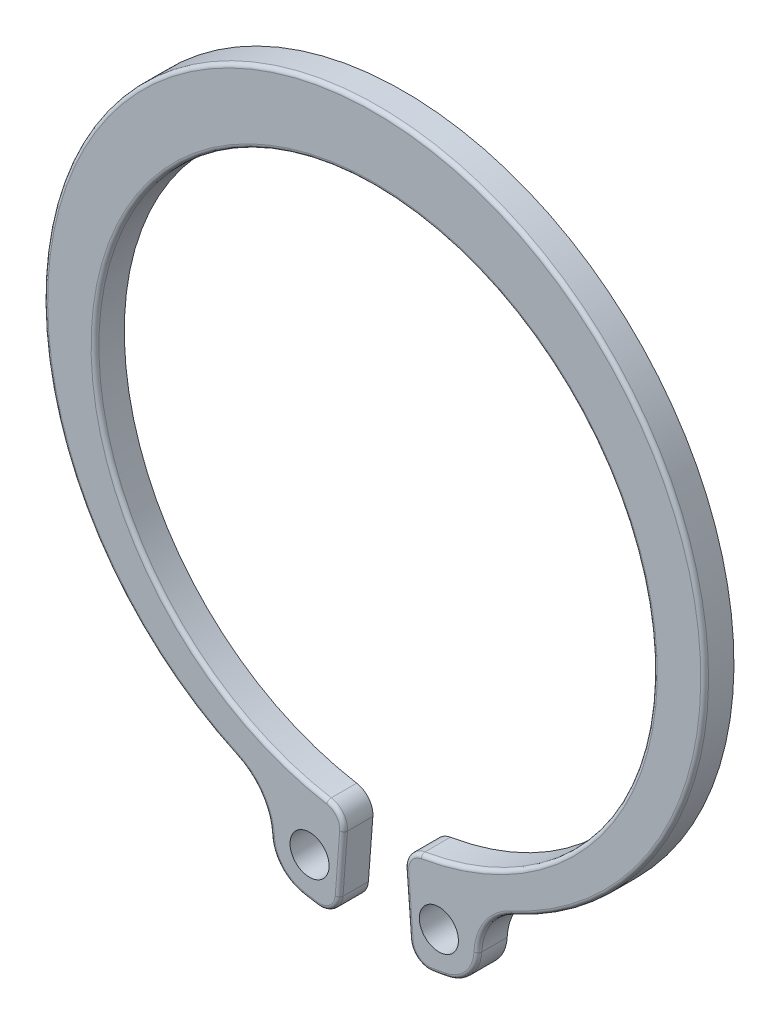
from build123d import *

# Parameters (mm, degrees)
ESQUISSE1_R          = 1
BASE_EXTRUSION_DEPTH = 1.5
CONG_1_R             = 1
CONG_2_R             = 0.2


with BuildPart() as part:
    # Esquisse1 → Base-Extrusion (new body)
    with BuildSketch(Plane.XY):
        with BuildLine():
            Line((1.496865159, -14.221441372), (1.877447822, -19.206936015))
            ThreePointArc((1.877447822, -19.206936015), (2.789337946, -19.095831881), (3.69490774, -18.941458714))
            ThreePointArc((3.69490774, -18.941458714), (4.822315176, -18.289528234), (5.309319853, -17.081684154))
            ThreePointArc((5.309319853, -17.081684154), (5.822961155, -15.551919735), (7.054833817, -14.509568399))
            ThreePointArc((7.054833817, -14.509568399), (0, 17.8), (-7.054833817, -14.509568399))
            ThreePointArc((-7.054833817, -14.509568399), (-5.822961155, -15.551919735), (-5.309319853, -17.081684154))
            ThreePointArc((-5.309319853, -17.081684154), (-4.822315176, -18.289528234), (-3.69490774, -18.941458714))
            ThreePointArc((-3.69490774, -18.941458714), (-2.789337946, -19.095831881), (-1.877447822, -19.206936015))
            Line((-1.877447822, -19.206936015), (-1.496865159, -14.221441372))
            ThreePointArc((-1.496865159, -14.221441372), (0, 14.3), (1.496865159, -14.221441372))
        make_face()
        with Locations((3.311985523, -16.978458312)):
            Circle(ESQUISSE1_R, mode=Mode.SUBTRACT)
        with Locations(Location((-3.311985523, -16.978458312, 0), (0, 0, 180))):
            Circle(ESQUISSE1_R, mode=Mode.SUBTRACT)
    extrude(amount=BASE_EXTRUSION_DEPTH)

    # Cong_1
    cong_1_edges = [part.edges().sort_by_distance(p)[0] for p in [
        (-1.496865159, -14.221441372, 0.75),
        (-1.877447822, -19.206936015, 0.75),
        (1.877447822, -19.206936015, 0.75),
        (1.496865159, -14.221441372, 0.75),
    ]]
    fillet(cong_1_edges, radius=CONG_1_R)

    # Cong_2
    cong_2_edges = [part.edges().sort_by_distance(p)[0] for p in [
        (4.822315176, -18.289528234, 1.5),
        (5.822961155, -15.551919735, 1.5),
        (0, 17.8, 1.5),
        (-5.822961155, -15.551919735, 1.5),
        (-4.822315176, -18.289528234, 1.5),
        (-3.321768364, -19.01044598, 1.5),
        (3.321768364, -19.01044598, 1.5),
        (1.682997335, -16.659705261, 1.5),
        (0, 14.3, 1.5),
        (-1.682997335, -16.659705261, 1.5),
        (-1.777461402, -14.467829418, 1.5),
        (1.777461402, -14.467829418, 1.5),
        (-2.173132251, -18.867237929, 1.5),
        (2.173132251, -18.867237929, 1.5),
    ]]
    fillet(cong_2_edges, radius=CONG_2_R)


solid = part.part
